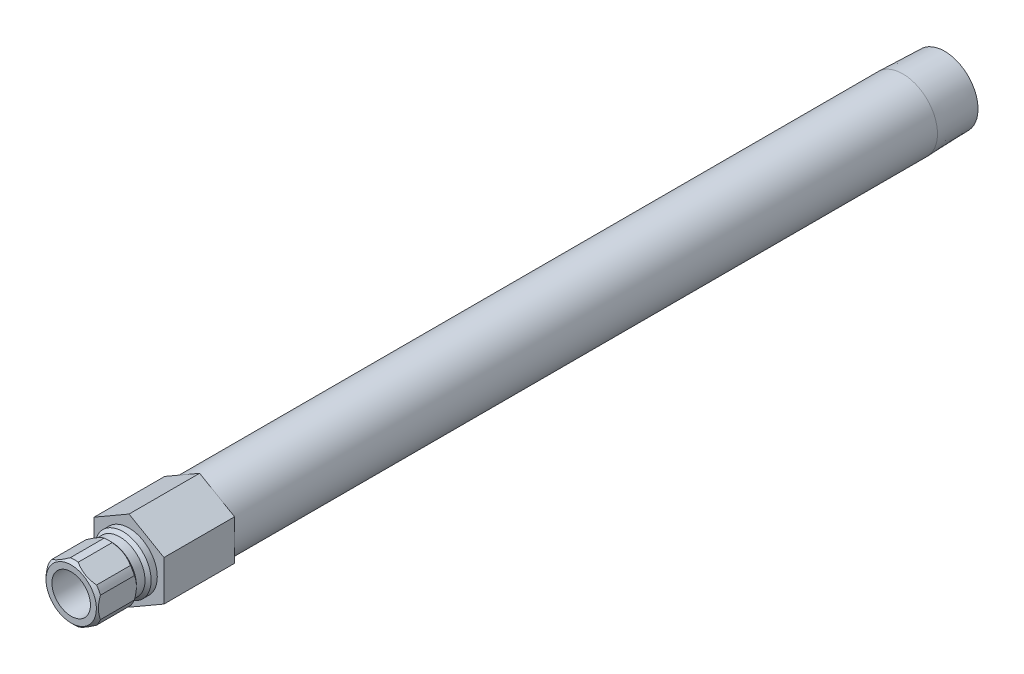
ISO-10303-21;
HEADER;
FILE_DESCRIPTION(('STEP AP214'),'2;1');
FILE_NAME('part.step','',(''),(''),'','','');
FILE_SCHEMA(('AUTOMOTIVE_DESIGN { 1 0 10303 214 1 1 1 1 }'));
ENDSEC;
DATA;
#1=APPLICATION_CONTEXT('core data for automotive mechanical design processes');
#2=APPLICATION_PROTOCOL_DEFINITION('international standard','automotive_design',2000,#1);
#3=PRODUCT_CONTEXT('',#1,'mechanical');
#4=PRODUCT('Part','Part','',(#3));
#5=PRODUCT_RELATED_PRODUCT_CATEGORY('part','',(#4));
#6=PRODUCT_DEFINITION_FORMATION('','',#4);
#7=PRODUCT_DEFINITION_CONTEXT('part definition',#1,'design');
#8=PRODUCT_DEFINITION('design','',#6,#7);
#9=PRODUCT_DEFINITION_SHAPE('','',#8);
#10=(LENGTH_UNIT() NAMED_UNIT(*) SI_UNIT(.MILLI.,.METRE.));
#11=(NAMED_UNIT(*) PLANE_ANGLE_UNIT() SI_UNIT($,.RADIAN.));
#12=(NAMED_UNIT(*) SI_UNIT($,.STERADIAN.) SOLID_ANGLE_UNIT());
#13=UNCERTAINTY_MEASURE_WITH_UNIT(LENGTH_MEASURE(1.E-05),#10,'distance_accuracy_value','');
#14=(GEOMETRIC_REPRESENTATION_CONTEXT(3) GLOBAL_UNCERTAINTY_ASSIGNED_CONTEXT((#13)) GLOBAL_UNIT_ASSIGNED_CONTEXT((#10,
#11,#12)) REPRESENTATION_CONTEXT('',''));
#15=CARTESIAN_POINT('',(0.,0.,0.));
#16=DIRECTION('',(0.,0.,1.));
#17=DIRECTION('',(1.,0.,0.));
#18=AXIS2_PLACEMENT_3D('',#15,#16,#17);
#19=CARTESIAN_POINT('',(0.,0.,0.));
#20=DIRECTION('',(0.,0.,-1.));
#21=DIRECTION('',(0.,1.,0.));
#22=AXIS2_PLACEMENT_3D('',#19,#20,#21);
#23=CYLINDRICAL_SURFACE('',#22,6.985);
#24=DIRECTION('',(0.,0.,-1.));
#25=VECTOR('',#24,1.);
#26=CARTESIAN_POINT('',(5.50323442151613,-4.30170151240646,0.));
#27=LINE('',#26,#25);
#28=CARTESIAN_POINT('',(5.50323442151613,-4.30170151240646,5.1562));
#29=VERTEX_POINT('',#28);
#30=CARTESIAN_POINT('',(5.50323442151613,-4.30170151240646,13.5382));
#31=VERTEX_POINT('',#30);
#32=EDGE_CURVE('E406',#29,#31,#27,.F.);
#33=ORIENTED_EDGE('',*,*,#32,.F.);
#34=CARTESIAN_POINT('',(0.,0.,5.1562));
#35=DIRECTION('',(0.,0.,-1.));
#36=DIRECTION('',(0.,1.,0.));
#37=AXIS2_PLACEMENT_3D('',#34,#35,#36);
#38=CIRCLE('',#37,6.985);
#39=CARTESIAN_POINT('',(6.477,-2.6150900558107,5.1562));
#40=VERTEX_POINT('',#39);
#41=EDGE_CURVE('E383',#40,#29,#38,.T.);
#42=ORIENTED_EDGE('',*,*,#41,.F.);
#43=DIRECTION('',(0.,0.,-1.));
#44=VECTOR('',#43,1.);
#45=CARTESIAN_POINT('',(6.477,-2.6150900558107,0.));
#46=LINE('',#45,#44);
#47=CARTESIAN_POINT('',(6.477,-2.6150900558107,13.5382));
#48=VERTEX_POINT('',#47);
#49=EDGE_CURVE('E397',#48,#40,#46,.T.);
#50=ORIENTED_EDGE('',*,*,#49,.F.);
#51=CARTESIAN_POINT('',(0.,0.,13.5382));
#52=DIRECTION('',(0.,0.,-1.));
#53=DIRECTION('',(0.,1.,0.));
#54=AXIS2_PLACEMENT_3D('',#51,#52,#53);
#55=CIRCLE('',#54,6.985);
#56=EDGE_CURVE('E191',#48,#31,#55,.T.);
#57=ORIENTED_EDGE('',*,*,#56,.T.);
#58=EDGE_LOOP('',(#33,#42,#50,#57));
#59=FACE_BOUND('',#58,.T.);
#60=ADVANCED_FACE('F34',(#59),#23,.T.);
#61=DIRECTION('',(0.,0.,-1.));
#62=VECTOR('',#61,1.);
#63=CARTESIAN_POINT('',(6.477,2.61509005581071,0.));
#64=LINE('',#63,#62);
#65=CARTESIAN_POINT('',(6.477,2.6150900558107,5.1562));
#66=VERTEX_POINT('',#65);
#67=CARTESIAN_POINT('',(6.477,2.61509005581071,13.5382));
#68=VERTEX_POINT('',#67);
#69=EDGE_CURVE('E309',#66,#68,#64,.F.);
#70=ORIENTED_EDGE('',*,*,#69,.F.);
#71=CARTESIAN_POINT('',(5.50323442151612,4.30170151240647,5.1562));
#72=VERTEX_POINT('',#71);
#73=EDGE_CURVE('E204',#72,#66,#38,.T.);
#74=ORIENTED_EDGE('',*,*,#73,.F.);
#75=DIRECTION('',(0.,0.,-1.));
#76=VECTOR('',#75,1.);
#77=CARTESIAN_POINT('',(5.50323442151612,4.30170151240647,0.));
#78=LINE('',#77,#76);
#79=CARTESIAN_POINT('',(5.50323442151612,4.30170151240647,13.5382));
#80=VERTEX_POINT('',#79);
#81=EDGE_CURVE('E394',#80,#72,#78,.T.);
#82=ORIENTED_EDGE('',*,*,#81,.F.);
#83=EDGE_CURVE('E198',#80,#68,#55,.T.);
#84=ORIENTED_EDGE('',*,*,#83,.T.);
#85=EDGE_LOOP('',(#70,#74,#82,#84));
#86=FACE_BOUND('',#85,.T.);
#87=ADVANCED_FACE('F343',(#86),#23,.T.);
#88=DIRECTION('',(0.,0.,-1.));
#89=VECTOR('',#88,1.);
#90=CARTESIAN_POINT('',(0.973765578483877,6.91679156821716,0.));
#91=LINE('',#90,#89);
#92=CARTESIAN_POINT('',(0.973765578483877,6.91679156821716,5.1562));
#93=VERTEX_POINT('',#92);
#94=CARTESIAN_POINT('',(0.973765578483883,6.91679156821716,13.5382));
#95=VERTEX_POINT('',#94);
#96=EDGE_CURVE('E399',#93,#95,#91,.F.);
#97=ORIENTED_EDGE('',*,*,#96,.F.);
#98=CARTESIAN_POINT('',(-0.973765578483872,6.91679156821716,5.1562));
#99=VERTEX_POINT('',#98);
#100=EDGE_CURVE('E200',#99,#93,#38,.T.);
#101=ORIENTED_EDGE('',*,*,#100,.F.);
#102=DIRECTION('',(0.,0.,-1.));
#103=VECTOR('',#102,1.);
#104=CARTESIAN_POINT('',(-0.973765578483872,6.91679156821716,0.));
#105=LINE('',#104,#103);
#106=CARTESIAN_POINT('',(-0.973765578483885,6.91679156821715,13.5382));
#107=VERTEX_POINT('',#106);
#108=EDGE_CURVE('E375',#107,#99,#105,.T.);
#109=ORIENTED_EDGE('',*,*,#108,.F.);
#110=EDGE_CURVE('E193',#107,#95,#55,.T.);
#111=ORIENTED_EDGE('',*,*,#110,.T.);
#112=EDGE_LOOP('',(#97,#101,#109,#111));
#113=FACE_BOUND('',#112,.T.);
#114=ADVANCED_FACE('F348',(#113),#23,.T.);
#115=DIRECTION('',(0.,0.,-1.));
#116=VECTOR('',#115,1.);
#117=CARTESIAN_POINT('',(-5.50323442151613,4.30170151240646,0.));
#118=LINE('',#117,#116);
#119=CARTESIAN_POINT('',(-5.50323442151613,4.30170151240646,5.1562));
#120=VERTEX_POINT('',#119);
#121=CARTESIAN_POINT('',(-5.50323442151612,4.30170151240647,13.5382));
#122=VERTEX_POINT('',#121);
#123=EDGE_CURVE('E54',#120,#122,#118,.F.);
#124=ORIENTED_EDGE('',*,*,#123,.F.);
#125=CARTESIAN_POINT('',(-6.477,2.61509005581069,5.1562));
#126=VERTEX_POINT('',#125);
#127=EDGE_CURVE('E203',#126,#120,#38,.T.);
#128=ORIENTED_EDGE('',*,*,#127,.F.);
#129=DIRECTION('',(0.,0.,-1.));
#130=VECTOR('',#129,1.);
#131=CARTESIAN_POINT('',(-6.477,2.61509005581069,0.));
#132=LINE('',#131,#130);
#133=CARTESIAN_POINT('',(-6.477,2.61509005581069,13.5382));
#134=VERTEX_POINT('',#133);
#135=EDGE_CURVE('E263',#134,#126,#132,.T.);
#136=ORIENTED_EDGE('',*,*,#135,.F.);
#137=EDGE_CURVE('E189',#134,#122,#55,.T.);
#138=ORIENTED_EDGE('',*,*,#137,.T.);
#139=EDGE_LOOP('',(#124,#128,#136,#138));
#140=FACE_BOUND('',#139,.T.);
#141=ADVANCED_FACE('F360',(#140),#23,.T.);
#142=DIRECTION('',(0.,0.,-1.));
#143=VECTOR('',#142,1.);
#144=CARTESIAN_POINT('',(-6.477,-2.61509005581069,0.));
#145=LINE('',#144,#143);
#146=CARTESIAN_POINT('',(-6.477,-2.61509005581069,5.1562));
#147=VERTEX_POINT('',#146);
#148=CARTESIAN_POINT('',(-6.477,-2.6150900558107,13.5382));
#149=VERTEX_POINT('',#148);
#150=EDGE_CURVE('E62',#147,#149,#145,.F.);
#151=ORIENTED_EDGE('',*,*,#150,.F.);
#152=CARTESIAN_POINT('',(-5.50323442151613,-4.30170151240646,5.1562));
#153=VERTEX_POINT('',#152);
#154=EDGE_CURVE('E182',#153,#147,#38,.T.);
#155=ORIENTED_EDGE('',*,*,#154,.F.);
#156=DIRECTION('',(0.,0.,-1.));
#157=VECTOR('',#156,1.);
#158=CARTESIAN_POINT('',(-5.50323442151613,-4.30170151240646,0.));
#159=LINE('',#158,#157);
#160=CARTESIAN_POINT('',(-5.50323442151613,-4.30170151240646,13.5382));
#161=VERTEX_POINT('',#160);
#162=EDGE_CURVE('E165',#161,#153,#159,.T.);
#163=ORIENTED_EDGE('',*,*,#162,.F.);
#164=EDGE_CURVE('E180',#161,#149,#55,.T.);
#165=ORIENTED_EDGE('',*,*,#164,.T.);
#166=EDGE_LOOP('',(#151,#155,#163,#165));
#167=FACE_BOUND('',#166,.T.);
#168=ADVANCED_FACE('F179',(#167),#23,.T.);
#169=CARTESIAN_POINT('',(0.,0.,0.));
#170=DIRECTION('',(0.,0.,-1.));
#171=DIRECTION('',(0.,1.,0.));
#172=AXIS2_PLACEMENT_3D('',#169,#170,#171);
#173=CYLINDRICAL_SURFACE('',#172,8.57249999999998);
#174=CARTESIAN_POINT('',(0.,0.,-191.262));
#175=DIRECTION('',(0.,0.,-1.));
#176=DIRECTION('',(0.,1.,0.));
#177=AXIS2_PLACEMENT_3D('',#174,#175,#176);
#178=CIRCLE('',#177,8.57249999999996);
#179=CARTESIAN_POINT('',(0.,8.5725,-191.262));
#180=VERTEX_POINT('',#179);
#181=EDGE_CURVE('E214',#180,#180,#178,.T.);
#182=ORIENTED_EDGE('',*,*,#181,.F.);
#183=EDGE_LOOP('',(#182));
#184=FACE_BOUND('',#183,.T.);
#185=CARTESIAN_POINT('',(0.,0.,-17.4498));
#186=DIRECTION('',(0.,0.,1.));
#187=DIRECTION('',(1.,0.,0.));
#188=AXIS2_PLACEMENT_3D('',#185,#186,#187);
#189=CIRCLE('',#188,8.57249999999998);
#190=CARTESIAN_POINT('',(8.57249999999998,0.,-17.4498));
#191=VERTEX_POINT('',#190);
#192=EDGE_CURVE('E231',#191,#191,#189,.F.);
#193=ORIENTED_EDGE('',*,*,#192,.T.);
#194=EDGE_LOOP('',(#193));
#195=FACE_BOUND('',#194,.T.);
#196=ADVANCED_FACE('F359',(#184,#195),#173,.T.);
#197=CARTESIAN_POINT('',(0.,0.,0.));
#198=DIRECTION('',(0.,0.,-1.));
#199=DIRECTION('',(0.,1.,0.));
#200=AXIS2_PLACEMENT_3D('',#197,#198,#199);
#201=CYLINDRICAL_SURFACE('',#200,4.76249999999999);
#202=CARTESIAN_POINT('',(0.,0.,14.3002));
#203=DIRECTION('',(0.,0.,-1.));
#204=DIRECTION('',(0.,1.,0.));
#205=AXIS2_PLACEMENT_3D('',#202,#203,#204);
#206=CIRCLE('',#205,4.7625);
#207=CARTESIAN_POINT('',(0.,4.7625,14.3002));
#208=VERTEX_POINT('',#207);
#209=EDGE_CURVE('E233',#208,#208,#206,.T.);
#210=ORIENTED_EDGE('',*,*,#209,.F.);
#211=EDGE_LOOP('',(#210));
#212=FACE_BOUND('',#211,.T.);
#213=CARTESIAN_POINT('',(0.,0.,-17.4498));
#214=DIRECTION('',(0.,0.,-1.));
#215=DIRECTION('',(0.,1.,0.));
#216=AXIS2_PLACEMENT_3D('',#213,#214,#215);
#217=CIRCLE('',#216,4.76249999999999);
#218=CARTESIAN_POINT('',(0.,4.7625,-17.4498));
#219=VERTEX_POINT('',#218);
#220=EDGE_CURVE('E226',#219,#219,#217,.T.);
#221=ORIENTED_EDGE('',*,*,#220,.T.);
#222=EDGE_LOOP('',(#221));
#223=FACE_BOUND('',#222,.T.);
#224=ADVANCED_FACE('F36',(#212,#223),#201,.F.);
#225=CARTESIAN_POINT('',(0.,4.7625,-17.4498));
#226=DIRECTION('',(0.,0.,-1.));
#227=DIRECTION('',(0.,1.,0.));
#228=AXIS2_PLACEMENT_3D('',#225,#226,#227);
#229=PLANE('',#228);
#230=CARTESIAN_POINT('',(0.,0.,-17.4498));
#231=DIRECTION('',(0.,0.,-1.));
#232=DIRECTION('',(0.,1.,0.));
#233=AXIS2_PLACEMENT_3D('',#230,#231,#232);
#234=CIRCLE('',#233,6.26109999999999);
#235=CARTESIAN_POINT('',(0.,6.2611,-17.4498));
#236=VERTEX_POINT('',#235);
#237=EDGE_CURVE('E223',#236,#236,#234,.T.);
#238=ORIENTED_EDGE('',*,*,#237,.T.);
#239=EDGE_LOOP('',(#238));
#240=FACE_BOUND('',#239,.T.);
#241=ORIENTED_EDGE('',*,*,#220,.F.);
#242=EDGE_LOOP('',(#241));
#243=FACE_BOUND('',#242,.T.);
#244=ADVANCED_FACE('F687',(#240,#243),#229,.T.);
#245=CARTESIAN_POINT('',(0.,0.,0.));
#246=DIRECTION('',(0.,0.,-1.));
#247=DIRECTION('',(0.,1.,0.));
#248=AXIS2_PLACEMENT_3D('',#245,#246,#247);
#249=CYLINDRICAL_SURFACE('',#248,6.26109999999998);
#250=CARTESIAN_POINT('',(0.,0.,-201.5998));
#251=DIRECTION('',(0.,0.,-1.));
#252=DIRECTION('',(0.,1.,0.));
#253=AXIS2_PLACEMENT_3D('',#250,#251,#252);
#254=CIRCLE('',#253,6.26109999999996);
#255=CARTESIAN_POINT('',(0.,6.2611,-201.5998));
#256=VERTEX_POINT('',#255);
#257=EDGE_CURVE('E220',#256,#256,#254,.T.);
#258=ORIENTED_EDGE('',*,*,#257,.T.);
#259=EDGE_LOOP('',(#258));
#260=FACE_BOUND('',#259,.T.);
#261=ORIENTED_EDGE('',*,*,#237,.F.);
#262=EDGE_LOOP('',(#261));
#263=FACE_BOUND('',#262,.T.);
#264=ADVANCED_FACE('F678',(#260,#263),#249,.F.);
#265=CARTESIAN_POINT('',(0.,8.24944566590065,-201.5998));
#266=DIRECTION('',(0.,0.,-1.));
#267=DIRECTION('',(0.,1.,0.));
#268=AXIS2_PLACEMENT_3D('',#265,#266,#267);
#269=PLANE('',#268);
#270=CARTESIAN_POINT('',(0.,0.,-201.5998));
#271=DIRECTION('',(0.,0.,-1.));
#272=DIRECTION('',(0.,1.,0.));
#273=AXIS2_PLACEMENT_3D('',#270,#271,#272);
#274=CIRCLE('',#273,8.24944566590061);
#275=CARTESIAN_POINT('',(0.,8.24944566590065,-201.5998));
#276=VERTEX_POINT('',#275);
#277=EDGE_CURVE('E217',#276,#276,#274,.T.);
#278=ORIENTED_EDGE('',*,*,#277,.T.);
#279=EDGE_LOOP('',(#278));
#280=FACE_BOUND('',#279,.T.);
#281=ORIENTED_EDGE('',*,*,#257,.F.);
#282=EDGE_LOOP('',(#281));
#283=FACE_BOUND('',#282,.T.);
#284=ADVANCED_FACE('F669',(#280,#283),#269,.T.);
#285=CARTESIAN_POINT('',(0.,0.,-201.5998));
#286=DIRECTION('',(0.,0.,1.));
#287=DIRECTION('',(0.,-1.,0.));
#288=AXIS2_PLACEMENT_3D('',#285,#286,#287);
#289=CONICAL_SURFACE('',#288,8.24944566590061,0.0312396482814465);
#290=ORIENTED_EDGE('',*,*,#181,.T.);
#291=EDGE_LOOP('',(#290));
#292=FACE_BOUND('',#291,.T.);
#293=ORIENTED_EDGE('',*,*,#277,.F.);
#294=EDGE_LOOP('',(#293));
#295=FACE_BOUND('',#294,.T.);
#296=ADVANCED_FACE('F661',(#292,#295),#289,.T.);
#297=CARTESIAN_POINT('',(0.,0.,0.));
#298=DIRECTION('',(0.,0.,-1.));
#299=DIRECTION('',(0.,1.,0.));
#300=AXIS2_PLACEMENT_3D('',#297,#298,#299);
#301=CYLINDRICAL_SURFACE('',#300,6.985);
#302=CARTESIAN_POINT('',(0.,0.,0.));
#303=DIRECTION('',(0.,0.,1.));
#304=DIRECTION('',(1.,0.,0.));
#305=AXIS2_PLACEMENT_3D('',#302,#303,#304);
#306=CIRCLE('',#305,6.985);
#307=CARTESIAN_POINT('',(6.985,0.,0.));
#308=VERTEX_POINT('',#307);
#309=EDGE_CURVE('E174',#308,#308,#306,.F.);
#310=ORIENTED_EDGE('',*,*,#309,.F.);
#311=EDGE_LOOP('',(#310));
#312=FACE_BOUND('',#311,.T.);
#313=CARTESIAN_POINT('',(0.,0.,1.50875999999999));
#314=DIRECTION('',(0.,0.,-1.));
#315=DIRECTION('',(0.,1.,0.));
#316=AXIS2_PLACEMENT_3D('',#313,#314,#315);
#317=CIRCLE('',#316,6.985);
#318=CARTESIAN_POINT('',(0.,6.985,1.50876));
#319=VERTEX_POINT('',#318);
#320=EDGE_CURVE('E211',#319,#319,#317,.T.);
#321=ORIENTED_EDGE('',*,*,#320,.T.);
#322=EDGE_LOOP('',(#321));
#323=FACE_BOUND('',#322,.T.);
#324=ADVANCED_FACE('F653',(#312,#323),#301,.T.);
#325=CARTESIAN_POINT('',(0.,0.,1.50875999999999));
#326=DIRECTION('',(0.,0.,-1.));
#327=DIRECTION('',(0.,1.,0.));
#328=AXIS2_PLACEMENT_3D('',#325,#326,#327);
#329=CONICAL_SURFACE('',#328,6.985,0.785398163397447);
#330=CARTESIAN_POINT('',(0.,0.,2.27076));
#331=DIRECTION('',(0.,0.,-1.));
#332=DIRECTION('',(0.,1.,0.));
#333=AXIS2_PLACEMENT_3D('',#330,#331,#332);
#334=CIRCLE('',#333,6.223);
#335=CARTESIAN_POINT('',(0.,6.223,2.27076));
#336=VERTEX_POINT('',#335);
#337=EDGE_CURVE('E208',#336,#336,#334,.T.);
#338=ORIENTED_EDGE('',*,*,#337,.T.);
#339=EDGE_LOOP('',(#338));
#340=FACE_BOUND('',#339,.T.);
#341=ORIENTED_EDGE('',*,*,#320,.F.);
#342=EDGE_LOOP('',(#341));
#343=FACE_BOUND('',#342,.T.);
#344=ADVANCED_FACE('F645',(#340,#343),#329,.T.);
#345=CARTESIAN_POINT('',(0.,0.,0.));
#346=DIRECTION('',(0.,0.,-1.));
#347=DIRECTION('',(0.,1.,0.));
#348=AXIS2_PLACEMENT_3D('',#345,#346,#347);
#349=CYLINDRICAL_SURFACE('',#348,6.223);
#350=CARTESIAN_POINT('',(0.,0.,4.3942));
#351=DIRECTION('',(0.,0.,-1.));
#352=DIRECTION('',(0.,1.,0.));
#353=AXIS2_PLACEMENT_3D('',#350,#351,#352);
#354=CIRCLE('',#353,6.223);
#355=CARTESIAN_POINT('',(0.,6.223,4.3942));
#356=VERTEX_POINT('',#355);
#357=EDGE_CURVE('E205',#356,#356,#354,.T.);
#358=ORIENTED_EDGE('',*,*,#357,.T.);
#359=EDGE_LOOP('',(#358));
#360=FACE_BOUND('',#359,.T.);
#361=ORIENTED_EDGE('',*,*,#337,.F.);
#362=EDGE_LOOP('',(#361));
#363=FACE_BOUND('',#362,.T.);
#364=ADVANCED_FACE('F270',(#360,#363),#349,.T.);
#365=CARTESIAN_POINT('',(0.,0.,4.3942));
#366=DIRECTION('',(0.,0.,1.));
#367=DIRECTION('',(0.,-1.,0.));
#368=AXIS2_PLACEMENT_3D('',#365,#366,#367);
#369=CONICAL_SURFACE('',#368,6.223,0.785398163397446);
#370=CARTESIAN_POINT('',(0.973302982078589,-6.91705864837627,5.1564));
#371=CARTESIAN_POINT('',(1.1543052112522,-6.81255696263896,5.07808330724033));
#372=CARTESIAN_POINT('',(1.3378209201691,-6.70660411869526,5.00684558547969));
#373=CARTESIAN_POINT('',(1.70963160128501,-6.49193912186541,4.88134753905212));
#374=CARTESIAN_POINT('',(1.89793754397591,-6.38322063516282,4.82713086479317));
#375=CARTESIAN_POINT('',(2.27146153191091,-6.16756646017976,4.74047563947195));
#376=CARTESIAN_POINT('',(2.45655498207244,-6.06070270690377,4.70733772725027));
#377=CARTESIAN_POINT('',(2.82844640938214,-5.8459910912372,4.66198043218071));
#378=CARTESIAN_POINT('',(3.0152419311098,-5.73814464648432,4.64973461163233));
#379=CARTESIAN_POINT('',(3.3948057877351,-5.51900335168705,4.64689437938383));
#380=CARTESIAN_POINT('',(3.58757842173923,-5.40770601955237,4.65698827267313));
#381=CARTESIAN_POINT('',(3.97148128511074,-5.18605959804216,4.69952919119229));
#382=CARTESIAN_POINT('',(4.1626089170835,-5.07571200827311,4.73200667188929));
#383=CARTESIAN_POINT('',(4.54854122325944,-4.85289388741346,4.81877263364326));
#384=CARTESIAN_POINT('',(4.74321398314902,-4.74049951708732,4.87383522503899));
#385=CARTESIAN_POINT('',(5.03141021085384,-4.57410934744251,4.97019209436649));
#386=CARTESIAN_POINT('',(5.12673323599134,-4.51907457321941,5.00455772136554));
#387=CARTESIAN_POINT('',(5.31613879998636,-4.40972121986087,5.07745547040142));
#388=CARTESIAN_POINT('',(5.41022179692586,-4.35540237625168,5.11598600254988));
#389=CARTESIAN_POINT('',(5.5036970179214,-4.30143443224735,5.1564));
#390=B_SPLINE_CURVE_WITH_KNOTS('',3,(#370,#371,#372,#373,#374,#375,#376,#377,#378,#379,#380,
#381,#382,#383,#384,#385,#386,#387,#388,#389),.UNSPECIFIED.,.F.,.F.,(4,2,2,2,2,2,2,2,2,4),(0.,
0.669810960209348,1.34132587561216,1.9892054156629,2.63626449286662,3.3035366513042,
3.9717185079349,4.66502165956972,5.01088265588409,5.35661208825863),.UNSPECIFIED.);
#391=CARTESIAN_POINT('',(0.973765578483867,-6.91679156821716,5.1562));
#392=VERTEX_POINT('',#391);
#393=EDGE_CURVE('E408',#392,#29,#390,.T.);
#394=ORIENTED_EDGE('',*,*,#393,.F.);
#395=CARTESIAN_POINT('',(-0.973765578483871,-6.91679156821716,5.1562));
#396=VERTEX_POINT('',#395);
#397=EDGE_CURVE('E381',#392,#396,#38,.T.);
#398=ORIENTED_EDGE('',*,*,#397,.T.);
#399=CARTESIAN_POINT('',(-5.50369701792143,-4.30143443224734,5.15640000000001));
#400=CARTESIAN_POINT('',(-5.32269478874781,-4.40593611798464,5.07808330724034));
#401=CARTESIAN_POINT('',(-5.13917907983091,-4.51188896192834,5.0068455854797));
#402=CARTESIAN_POINT('',(-4.767368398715,-4.72655395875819,4.88134753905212));
#403=CARTESIAN_POINT('',(-4.5790624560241,-4.83527244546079,4.82713086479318));
#404=CARTESIAN_POINT('',(-4.2055384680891,-5.05092662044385,4.74047563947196));
#405=CARTESIAN_POINT('',(-4.02044501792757,-5.15779037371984,4.70733772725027));
#406=CARTESIAN_POINT('',(-3.64855359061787,-5.37250198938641,4.66198043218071));
#407=CARTESIAN_POINT('',(-3.46175806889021,-5.48034843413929,4.64973461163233));
#408=CARTESIAN_POINT('',(-3.08219421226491,-5.69948972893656,4.64689437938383));
#409=CARTESIAN_POINT('',(-2.88942157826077,-5.81078706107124,4.65698827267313));
#410=CARTESIAN_POINT('',(-2.50551871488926,-6.03243348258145,4.69952919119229));
#411=CARTESIAN_POINT('',(-2.3143910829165,-6.1427810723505,4.73200667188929));
#412=CARTESIAN_POINT('',(-1.92845877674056,-6.36559919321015,4.81877263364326));
#413=CARTESIAN_POINT('',(-1.73378601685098,-6.47799356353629,4.87383522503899));
#414=CARTESIAN_POINT('',(-1.44558978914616,-6.6443837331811,4.97019209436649));
#415=CARTESIAN_POINT('',(-1.35026676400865,-6.69941850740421,5.00455772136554));
#416=CARTESIAN_POINT('',(-1.16086120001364,-6.80877186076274,5.07745547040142));
#417=CARTESIAN_POINT('',(-1.06677820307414,-6.86309070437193,5.11598600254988));
#418=CARTESIAN_POINT('',(-0.973302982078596,-6.91705864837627,5.1564));
#419=B_SPLINE_CURVE_WITH_KNOTS('',3,(#399,#400,#401,#402,#403,#404,#405,#406,#407,#408,#409,
#410,#411,#412,#413,#414,#415,#416,#417,#418),.UNSPECIFIED.,.F.,.F.,(4,2,2,2,2,2,2,2,2,4),(0.,
0.669810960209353,1.34132587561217,1.98920541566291,2.63626449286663,3.30353665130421,
3.97171850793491,4.66502165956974,5.01088265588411,5.35661208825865),.UNSPECIFIED.);
#420=EDGE_CURVE('E256',#153,#396,#419,.T.);
#421=ORIENTED_EDGE('',*,*,#420,.F.);
#422=ORIENTED_EDGE('',*,*,#154,.T.);
#423=CARTESIAN_POINT('',(-6.477,-7.50531717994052,8.08489330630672));
#424=CARTESIAN_POINT('',(-6.477,-7.32278230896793,7.94673378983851));
#425=CARTESIAN_POINT('',(-6.477,-7.13923073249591,7.80989578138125));
#426=CARTESIAN_POINT('',(-6.477,-6.76969107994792,7.53945615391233));
#427=CARTESIAN_POINT('',(-6.477,-6.58370240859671,7.40585534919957));
#428=CARTESIAN_POINT('',(-6.477,-6.20752484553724,7.14153325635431));
#429=CARTESIAN_POINT('',(-6.477,-6.01731457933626,7.01084228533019));
#430=CARTESIAN_POINT('',(-6.477,-5.63367369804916,6.75429124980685));
#431=CARTESIAN_POINT('',(-6.477,-5.44024331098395,6.62843084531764));
#432=CARTESIAN_POINT('',(-6.477,-5.03831720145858,6.37548971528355));
#433=CARTESIAN_POINT('',(-6.477,-4.82959841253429,6.24876164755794));
#434=CARTESIAN_POINT('',(-6.477,-4.40728395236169,6.00357587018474));
#435=CARTESIAN_POINT('',(-6.477,-4.19368750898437,5.88511948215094));
#436=CARTESIAN_POINT('',(-6.477,-3.7616267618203,5.6590284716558));
#437=CARTESIAN_POINT('',(-6.477,-3.54317924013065,5.55136202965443));
#438=CARTESIAN_POINT('',(-6.477,-3.100295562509,5.34926153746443));
#439=CARTESIAN_POINT('',(-6.477,-2.87586219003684,5.25482146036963));
#440=CARTESIAN_POINT('',(-6.477,-2.43955826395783,5.0897033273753));
#441=CARTESIAN_POINT('',(-6.477,-2.22819339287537,5.0177028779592));
#442=CARTESIAN_POINT('',(-6.477,-1.80033354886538,4.8906524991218));
#443=CARTESIAN_POINT('',(-6.477,-1.58383822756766,4.8356037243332));
#444=CARTESIAN_POINT('',(-6.477,-1.15063390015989,4.74626140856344));
#445=CARTESIAN_POINT('',(-6.477,-0.934000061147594,4.7116093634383));
#446=CARTESIAN_POINT('',(-6.477,-0.498364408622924,4.66374056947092));
#447=CARTESIAN_POINT('',(-6.477,-0.279363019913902,4.65052003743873));
#448=CARTESIAN_POINT('',(-6.477,0.15069719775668,4.64651642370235));
#449=CARTESIAN_POINT('',(-6.477,0.361748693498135,4.65491764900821));
#450=CARTESIAN_POINT('',(-6.477,0.782066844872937,4.69188275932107));
#451=CARTESIAN_POINT('',(-6.477,0.991333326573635,4.72044858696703));
#452=CARTESIAN_POINT('',(-6.477,1.41010575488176,4.79666246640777));
#453=CARTESIAN_POINT('',(-6.477,1.61955133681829,4.84463689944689));
#454=CARTESIAN_POINT('',(-6.477,2.03387291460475,4.95709535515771));
#455=CARTESIAN_POINT('',(-6.477,2.2387492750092,5.0215780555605));
#456=CARTESIAN_POINT('',(-6.477,2.66141718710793,5.17064013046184));
#457=CARTESIAN_POINT('',(-6.477,2.87875617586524,5.25648961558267));
#458=CARTESIAN_POINT('',(-6.477,3.30779766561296,5.44138196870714));
#459=CARTESIAN_POINT('',(-6.477,3.51949749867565,5.54043095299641));
#460=CARTESIAN_POINT('',(-6.477,3.93828980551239,5.74936705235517));
#461=CARTESIAN_POINT('',(-6.477,4.14536521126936,5.85928810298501));
#462=CARTESIAN_POINT('',(-6.477,4.55475391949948,6.08754039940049));
#463=CARTESIAN_POINT('',(-6.477,4.75706796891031,6.20587031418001));
#464=CARTESIAN_POINT('',(-6.477,5.14761370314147,6.44323908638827));
#465=CARTESIAN_POINT('',(-6.477,5.33604552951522,6.56195038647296));
#466=CARTESIAN_POINT('',(-6.477,5.7096738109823,6.80437488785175));
#467=CARTESIAN_POINT('',(-6.477,5.89487001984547,6.92808846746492));
#468=CARTESIAN_POINT('',(-6.477,6.26095063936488,7.17860412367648));
#469=CARTESIAN_POINT('',(-6.477,6.44185783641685,7.3053730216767));
#470=CARTESIAN_POINT('',(-6.477,6.8011983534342,7.56227065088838));
#471=CARTESIAN_POINT('',(-6.477,6.97963234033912,7.69239844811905));
#472=CARTESIAN_POINT('',(-6.477,7.15703038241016,7.82389977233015));
#473=B_SPLINE_CURVE_WITH_KNOTS('',3,(#423,#424,#425,#426,#427,#428,#429,#430,#431,#432,#433,
#434,#435,#436,#437,#438,#439,#440,#441,#442,#443,#444,#445,#446,#447,#448,#449,#450,#451,#452,
#453,#454,#455,#456,#457,#458,#459,#460,#461,#462,#463,#464,#465,#466,#467,#468,#469,#470,#471,
#472),.UNSPECIFIED.,.F.,.F.,(4,2,2,2,2,2,2,2,2,2,2,2,2,2,2,2,2,2,2,2,2,2,2,2,4),(0.,
0.686790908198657,1.37375281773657,2.06603541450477,2.75826919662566,3.49065471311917,
4.22315698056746,4.95343127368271,5.68337170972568,6.352659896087,7.02199365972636,
7.67918147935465,8.33625327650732,8.96890298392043,9.60161364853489,10.2454384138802,
10.8892116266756,11.5897073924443,12.2905288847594,12.9936114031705,13.6965828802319,
14.3646145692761,15.0326968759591,15.6953618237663,16.3578444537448),.UNSPECIFIED.);
#474=EDGE_CURVE('E279',#126,#147,#473,.F.);
#475=ORIENTED_EDGE('',*,*,#474,.F.);
#476=ORIENTED_EDGE('',*,*,#127,.T.);
#477=CARTESIAN_POINT('',(-0.973302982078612,6.91705864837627,5.1564));
#478=CARTESIAN_POINT('',(-1.15430521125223,6.81255696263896,5.07808330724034));
#479=CARTESIAN_POINT('',(-1.33782092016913,6.70660411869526,5.0068455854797));
#480=CARTESIAN_POINT('',(-1.70963160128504,6.49193912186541,4.88134753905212));
#481=CARTESIAN_POINT('',(-1.89793754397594,6.38322063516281,4.82713086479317));
#482=CARTESIAN_POINT('',(-2.27146153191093,6.16756646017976,4.74047563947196));
#483=CARTESIAN_POINT('',(-2.45655498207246,6.06070270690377,4.70733772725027));
#484=CARTESIAN_POINT('',(-2.82844640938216,5.8459910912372,4.66198043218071));
#485=CARTESIAN_POINT('',(-3.01524193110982,5.73814464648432,4.64973461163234));
#486=CARTESIAN_POINT('',(-3.39480578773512,5.51900335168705,4.64689437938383));
#487=CARTESIAN_POINT('',(-3.58757842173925,5.40770601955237,4.65698827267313));
#488=CARTESIAN_POINT('',(-3.97148128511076,5.18605959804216,4.6995291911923));
#489=CARTESIAN_POINT('',(-4.16260891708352,5.07571200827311,4.7320066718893));
#490=CARTESIAN_POINT('',(-4.54854122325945,4.85289388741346,4.81877263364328));
#491=CARTESIAN_POINT('',(-4.74321398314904,4.74049951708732,4.873835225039));
#492=CARTESIAN_POINT('',(-5.03141021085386,4.57410934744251,4.9701920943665));
#493=CARTESIAN_POINT('',(-5.12673323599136,4.51907457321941,5.00455772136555));
#494=CARTESIAN_POINT('',(-5.31613879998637,4.40972121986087,5.07745547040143));
#495=CARTESIAN_POINT('',(-5.41022179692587,4.35540237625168,5.11598600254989));
#496=CARTESIAN_POINT('',(-5.50369701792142,4.30143443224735,5.15640000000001));
#497=B_SPLINE_CURVE_WITH_KNOTS('',3,(#477,#478,#479,#480,#481,#482,#483,#484,#485,#486,#487,
#488,#489,#490,#491,#492,#493,#494,#495,#496),.UNSPECIFIED.,.F.,.F.,(4,2,2,2,2,2,2,2,2,4),(0.,
0.669810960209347,1.34132587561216,1.9892054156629,2.63626449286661,3.30353665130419,
3.97171850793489,4.66502165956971,5.01088265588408,5.35661208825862),.UNSPECIFIED.);
#498=EDGE_CURVE('E286',#99,#120,#497,.T.);
#499=ORIENTED_EDGE('',*,*,#498,.F.);
#500=ORIENTED_EDGE('',*,*,#100,.T.);
#501=CARTESIAN_POINT('',(5.50369701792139,4.30143443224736,5.1564));
#502=CARTESIAN_POINT('',(5.32269478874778,4.40593611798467,5.07808330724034));
#503=CARTESIAN_POINT('',(5.13917907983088,4.51188896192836,5.00684558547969));
#504=CARTESIAN_POINT('',(4.76736839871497,4.72655395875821,4.88134753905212));
#505=CARTESIAN_POINT('',(4.57906245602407,4.83527244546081,4.82713086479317));
#506=CARTESIAN_POINT('',(4.20553846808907,5.05092662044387,4.74047563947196));
#507=CARTESIAN_POINT('',(4.02044501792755,5.15779037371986,4.70733772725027));
#508=CARTESIAN_POINT('',(3.64855359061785,5.37250198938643,4.66198043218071));
#509=CARTESIAN_POINT('',(3.46175806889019,5.48034843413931,4.64973461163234));
#510=CARTESIAN_POINT('',(3.08219421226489,5.69948972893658,4.64689437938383));
#511=CARTESIAN_POINT('',(2.88942157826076,5.81078706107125,4.65698827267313));
#512=CARTESIAN_POINT('',(2.50551871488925,6.03243348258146,4.6995291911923));
#513=CARTESIAN_POINT('',(2.3143910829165,6.14278107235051,4.7320066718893));
#514=CARTESIAN_POINT('',(1.92845877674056,6.36559919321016,4.81877263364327));
#515=CARTESIAN_POINT('',(1.73378601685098,6.47799356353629,4.873835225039));
#516=CARTESIAN_POINT('',(1.44558978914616,6.6443837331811,4.97019209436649));
#517=CARTESIAN_POINT('',(1.35026676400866,6.69941850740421,5.00455772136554));
#518=CARTESIAN_POINT('',(1.16086120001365,6.80877186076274,5.07745547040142));
#519=CARTESIAN_POINT('',(1.06677820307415,6.86309070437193,5.11598600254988));
#520=CARTESIAN_POINT('',(0.973302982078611,6.91705864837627,5.1564));
#521=B_SPLINE_CURVE_WITH_KNOTS('',3,(#501,#502,#503,#504,#505,#506,#507,#508,#509,#510,#511,
#512,#513,#514,#515,#516,#517,#518,#519,#520),.UNSPECIFIED.,.F.,.F.,(4,2,2,2,2,2,2,2,2,4),(0.,
0.669810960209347,1.34132587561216,1.9892054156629,2.63626449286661,3.30353665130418,
3.97171850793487,4.66502165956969,5.01088265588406,5.35661208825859),.UNSPECIFIED.);
#522=EDGE_CURVE('E293',#72,#93,#521,.T.);
#523=ORIENTED_EDGE('',*,*,#522,.F.);
#524=ORIENTED_EDGE('',*,*,#73,.T.);
#525=CARTESIAN_POINT('',(6.477,-7.50531717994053,8.08489330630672));
#526=CARTESIAN_POINT('',(6.477,-7.32278230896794,7.94673378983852));
#527=CARTESIAN_POINT('',(6.477,-7.13923073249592,7.80989578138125));
#528=CARTESIAN_POINT('',(6.477,-6.76969107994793,7.53945615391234));
#529=CARTESIAN_POINT('',(6.477,-6.58370240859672,7.40585534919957));
#530=CARTESIAN_POINT('',(6.477,-6.20752484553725,7.14153325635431));
#531=CARTESIAN_POINT('',(6.477,-6.01731457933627,7.01084228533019));
#532=CARTESIAN_POINT('',(6.477,-5.63367369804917,6.75429124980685));
#533=CARTESIAN_POINT('',(6.477,-5.44024331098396,6.62843084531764));
#534=CARTESIAN_POINT('',(6.477,-5.03831720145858,6.37548971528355));
#535=CARTESIAN_POINT('',(6.477,-4.8295984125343,6.24876164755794));
#536=CARTESIAN_POINT('',(6.477,-4.4072839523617,6.00357587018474));
#537=CARTESIAN_POINT('',(6.477,-4.19368750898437,5.88511948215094));
#538=CARTESIAN_POINT('',(6.477,-3.7616267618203,5.6590284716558));
#539=CARTESIAN_POINT('',(6.477,-3.54317924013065,5.55136202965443));
#540=CARTESIAN_POINT('',(6.477,-3.100295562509,5.34926153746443));
#541=CARTESIAN_POINT('',(6.477,-2.87586219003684,5.25482146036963));
#542=CARTESIAN_POINT('',(6.477,-2.43955826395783,5.0897033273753));
#543=CARTESIAN_POINT('',(6.477,-2.22819339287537,5.0177028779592));
#544=CARTESIAN_POINT('',(6.477,-1.80033354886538,4.89065249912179));
#545=CARTESIAN_POINT('',(6.477,-1.58383822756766,4.8356037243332));
#546=CARTESIAN_POINT('',(6.477,-1.15063390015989,4.74626140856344));
#547=CARTESIAN_POINT('',(6.477,-0.934000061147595,4.71160936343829));
#548=CARTESIAN_POINT('',(6.477,-0.498364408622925,4.66374056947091));
#549=CARTESIAN_POINT('',(6.477,-0.279363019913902,4.65052003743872));
#550=CARTESIAN_POINT('',(6.477,0.150697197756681,4.64651642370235));
#551=CARTESIAN_POINT('',(6.477,0.361748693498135,4.6549176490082));
#552=CARTESIAN_POINT('',(6.477,0.782066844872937,4.69188275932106));
#553=CARTESIAN_POINT('',(6.477,0.991333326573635,4.72044858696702));
#554=CARTESIAN_POINT('',(6.477,1.41010575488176,4.79666246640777));
#555=CARTESIAN_POINT('',(6.477,1.6195513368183,4.84463689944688));
#556=CARTESIAN_POINT('',(6.477,2.03387291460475,4.95709535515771));
#557=CARTESIAN_POINT('',(6.477,2.2387492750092,5.02157805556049));
#558=CARTESIAN_POINT('',(6.477,2.66141718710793,5.17064013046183));
#559=CARTESIAN_POINT('',(6.477,2.87875617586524,5.25648961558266));
#560=CARTESIAN_POINT('',(6.477,3.30779766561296,5.44138196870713));
#561=CARTESIAN_POINT('',(6.477,3.51949749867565,5.54043095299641));
#562=CARTESIAN_POINT('',(6.477,3.93828980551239,5.74936705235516));
#563=CARTESIAN_POINT('',(6.477,4.14536521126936,5.859288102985));
#564=CARTESIAN_POINT('',(6.477,4.55475391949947,6.08754039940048));
#565=CARTESIAN_POINT('',(6.477,4.75706796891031,6.20587031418));
#566=CARTESIAN_POINT('',(6.477,5.14761370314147,6.44323908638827));
#567=CARTESIAN_POINT('',(6.477,5.33604552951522,6.56195038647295));
#568=CARTESIAN_POINT('',(6.477,5.7096738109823,6.80437488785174));
#569=CARTESIAN_POINT('',(6.477,5.89487001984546,6.92808846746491));
#570=CARTESIAN_POINT('',(6.477,6.26095063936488,7.17860412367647));
#571=CARTESIAN_POINT('',(6.477,6.44185783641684,7.3053730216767));
#572=CARTESIAN_POINT('',(6.477,6.80119835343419,7.56227065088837));
#573=CARTESIAN_POINT('',(6.477,6.97963234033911,7.69239844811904));
#574=CARTESIAN_POINT('',(6.477,7.15703038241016,7.82389977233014));
#575=B_SPLINE_CURVE_WITH_KNOTS('',3,(#525,#526,#527,#528,#529,#530,#531,#532,#533,#534,#535,
#536,#537,#538,#539,#540,#541,#542,#543,#544,#545,#546,#547,#548,#549,#550,#551,#552,#553,#554,
#555,#556,#557,#558,#559,#560,#561,#562,#563,#564,#565,#566,#567,#568,#569,#570,#571,#572,#573,
#574),.UNSPECIFIED.,.F.,.F.,(4,2,2,2,2,2,2,2,2,2,2,2,2,2,2,2,2,2,2,2,2,2,2,2,4),(0.,
0.686790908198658,1.37375281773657,2.06603541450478,2.75826919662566,3.49065471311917,
4.22315698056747,4.95343127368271,5.68337170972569,6.35265989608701,7.02199365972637,
7.67918147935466,8.33625327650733,8.96890298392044,9.6016136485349,10.2454384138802,
10.8892116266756,11.5897073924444,12.2905288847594,12.9936114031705,13.6965828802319,
14.3646145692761,15.0326968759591,15.6953618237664,16.3578444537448),.UNSPECIFIED.);
#576=EDGE_CURVE('E301',#40,#66,#575,.T.);
#577=ORIENTED_EDGE('',*,*,#576,.F.);
#578=ORIENTED_EDGE('',*,*,#41,.T.);
#579=EDGE_LOOP('',(#394,#398,#421,#422,#475,#476,#499,#500,#523,#524,#577,#578));
#580=FACE_BOUND('',#579,.T.);
#581=ORIENTED_EDGE('',*,*,#357,.F.);
#582=EDGE_LOOP('',(#581));
#583=FACE_BOUND('',#582,.T.);
#584=ADVANCED_FACE('F265',(#580,#583),#369,.T.);
#585=DIRECTION('',(0.,0.,-1.));
#586=VECTOR('',#585,1.);
#587=CARTESIAN_POINT('',(0.973765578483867,-6.91679156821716,0.));
#588=LINE('',#587,#586);
#589=CARTESIAN_POINT('',(0.973765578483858,-6.91679156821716,13.5382));
#590=VERTEX_POINT('',#589);
#591=EDGE_CURVE('E308',#590,#392,#588,.T.);
#592=ORIENTED_EDGE('',*,*,#591,.F.);
#593=CARTESIAN_POINT('',(-0.973765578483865,-6.91679156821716,13.5382));
#594=VERTEX_POINT('',#593);
#595=EDGE_CURVE('E188',#590,#594,#55,.T.);
#596=ORIENTED_EDGE('',*,*,#595,.T.);
#597=DIRECTION('',(0.,0.,-1.));
#598=VECTOR('',#597,1.);
#599=CARTESIAN_POINT('',(-0.973765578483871,-6.91679156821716,0.));
#600=LINE('',#599,#598);
#601=EDGE_CURVE('E168',#396,#594,#600,.F.);
#602=ORIENTED_EDGE('',*,*,#601,.F.);
#603=ORIENTED_EDGE('',*,*,#397,.F.);
#604=EDGE_LOOP('',(#592,#596,#602,#603));
#605=FACE_BOUND('',#604,.T.);
#606=ADVANCED_FACE('F269',(#605),#23,.T.);
#607=CARTESIAN_POINT('',(0.,0.,13.5382));
#608=DIRECTION('',(0.,0.,-1.));
#609=DIRECTION('',(0.,1.,0.));
#610=AXIS2_PLACEMENT_3D('',#607,#608,#609);
#611=CONICAL_SURFACE('',#610,6.985,0.78539816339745);
#612=CARTESIAN_POINT('',(5.5036970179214,-4.30143443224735,13.538));
#613=CARTESIAN_POINT('',(5.32269478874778,-4.40593611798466,13.6163166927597));
#614=CARTESIAN_POINT('',(5.13917907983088,-4.51188896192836,13.6875544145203));
#615=CARTESIAN_POINT('',(4.76736839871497,-4.72655395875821,13.8130524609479));
#616=CARTESIAN_POINT('',(4.57906245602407,-4.8352724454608,13.8672691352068));
#617=CARTESIAN_POINT('',(4.20553846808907,-5.05092662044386,13.953924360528));
#618=CARTESIAN_POINT('',(4.02044501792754,-5.15779037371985,13.9870622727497));
#619=CARTESIAN_POINT('',(3.64855359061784,-5.37250198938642,14.0324195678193));
#620=CARTESIAN_POINT('',(3.46175806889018,-5.4803484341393,14.0446653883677));
#621=CARTESIAN_POINT('',(3.08219421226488,-5.69948972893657,14.0475056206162));
#622=CARTESIAN_POINT('',(2.88942157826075,-5.81078706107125,14.0374117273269));
#623=CARTESIAN_POINT('',(2.50551871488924,-6.03243348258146,13.9948708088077));
#624=CARTESIAN_POINT('',(2.31439108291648,-6.14278107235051,13.9623933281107));
#625=CARTESIAN_POINT('',(1.92845877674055,-6.36559919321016,13.8756273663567));
#626=CARTESIAN_POINT('',(1.73378601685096,-6.4779935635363,13.820564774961));
#627=CARTESIAN_POINT('',(1.44558978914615,-6.64438373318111,13.7242079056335));
#628=CARTESIAN_POINT('',(1.35026676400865,-6.69941850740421,13.6898422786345));
#629=CARTESIAN_POINT('',(1.16086120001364,-6.80877186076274,13.6169445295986));
#630=CARTESIAN_POINT('',(1.06677820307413,-6.86309070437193,13.5784139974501));
#631=CARTESIAN_POINT('',(0.973302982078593,-6.91705864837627,13.538));
#632=B_SPLINE_CURVE_WITH_KNOTS('',3,(#612,#613,#614,#615,#616,#617,#618,#619,#620,#621,#622,
#623,#624,#625,#626,#627,#628,#629,#630,#631),.UNSPECIFIED.,.F.,.F.,(4,2,2,2,2,2,2,2,2,4),(0.,
0.66981096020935,1.34132587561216,1.98920541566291,2.63626449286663,3.3035366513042,
3.9717185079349,4.66502165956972,5.01088265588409,5.35661208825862),.UNSPECIFIED.);
#633=EDGE_CURVE('E12',#31,#590,#632,.T.);
#634=ORIENTED_EDGE('',*,*,#633,.F.);
#635=ORIENTED_EDGE('',*,*,#56,.F.);
#636=CARTESIAN_POINT('',(6.477,-7.50531717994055,10.6095066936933));
#637=CARTESIAN_POINT('',(6.477,-7.32278230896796,10.7476662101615));
#638=CARTESIAN_POINT('',(6.477,-7.13923073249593,10.8845042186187));
#639=CARTESIAN_POINT('',(6.477,-6.76969107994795,11.1549438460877));
#640=CARTESIAN_POINT('',(6.477,-6.58370240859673,11.2885446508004));
#641=CARTESIAN_POINT('',(6.477,-6.20752484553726,11.5528667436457));
#642=CARTESIAN_POINT('',(6.477,-6.01731457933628,11.6835577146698));
#643=CARTESIAN_POINT('',(6.477,-5.63367369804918,11.9401087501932));
#644=CARTESIAN_POINT('',(6.477,-5.44024331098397,12.0659691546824));
#645=CARTESIAN_POINT('',(6.477,-5.03831720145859,12.3189102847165));
#646=CARTESIAN_POINT('',(6.477,-4.82959841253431,12.4456383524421));
#647=CARTESIAN_POINT('',(6.477,-4.4072839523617,12.6908241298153));
#648=CARTESIAN_POINT('',(6.477,-4.19368750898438,12.8092805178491));
#649=CARTESIAN_POINT('',(6.477,-3.76162676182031,13.0353715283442));
#650=CARTESIAN_POINT('',(6.477,-3.54317924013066,13.1430379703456));
#651=CARTESIAN_POINT('',(6.477,-3.100295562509,13.3451384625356));
#652=CARTESIAN_POINT('',(6.477,-2.87586219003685,13.4395785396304));
#653=CARTESIAN_POINT('',(6.477,-2.43955826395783,13.6046966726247));
#654=CARTESIAN_POINT('',(6.477,-2.22819339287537,13.6766971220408));
#655=CARTESIAN_POINT('',(6.477,-1.80033354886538,13.8037475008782));
#656=CARTESIAN_POINT('',(6.477,-1.58383822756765,13.8587962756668));
#657=CARTESIAN_POINT('',(6.477,-1.15063390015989,13.9481385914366));
#658=CARTESIAN_POINT('',(6.477,-0.934000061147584,13.9827906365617));
#659=CARTESIAN_POINT('',(6.477,-0.498364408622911,14.0306594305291));
#660=CARTESIAN_POINT('',(6.477,-0.279363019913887,14.0438799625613));
#661=CARTESIAN_POINT('',(6.477,0.150697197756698,14.0478835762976));
#662=CARTESIAN_POINT('',(6.477,0.361748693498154,14.0394823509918));
#663=CARTESIAN_POINT('',(6.477,0.782066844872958,14.0025172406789));
#664=CARTESIAN_POINT('',(6.477,0.991333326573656,13.973951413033));
#665=CARTESIAN_POINT('',(6.477,1.41010575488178,13.8977375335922));
#666=CARTESIAN_POINT('',(6.477,1.61955133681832,13.8497631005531));
#667=CARTESIAN_POINT('',(6.477,2.03387291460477,13.7373046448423));
#668=CARTESIAN_POINT('',(6.477,2.23874927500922,13.6728219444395));
#669=CARTESIAN_POINT('',(6.477,2.66141718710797,13.5237598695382));
#670=CARTESIAN_POINT('',(6.477,2.87875617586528,13.4379103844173));
#671=CARTESIAN_POINT('',(6.477,3.307797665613,13.2530180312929));
#672=CARTESIAN_POINT('',(6.477,3.51949749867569,13.1539690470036));
#673=CARTESIAN_POINT('',(6.477,3.93828980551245,12.9450329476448));
#674=CARTESIAN_POINT('',(6.477,4.14536521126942,12.835111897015));
#675=CARTESIAN_POINT('',(6.477,4.55475391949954,12.6068596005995));
#676=CARTESIAN_POINT('',(6.477,4.75706796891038,12.48852968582));
#677=CARTESIAN_POINT('',(6.477,5.14761370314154,12.2511609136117));
#678=CARTESIAN_POINT('',(6.477,5.3360455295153,12.132449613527));
#679=CARTESIAN_POINT('',(6.477,5.70967381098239,11.8900251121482));
#680=CARTESIAN_POINT('',(6.477,5.89487001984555,11.766311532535));
#681=CARTESIAN_POINT('',(6.477,6.26095063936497,11.5157958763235));
#682=CARTESIAN_POINT('',(6.477,6.44185783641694,11.3890269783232));
#683=CARTESIAN_POINT('',(6.477,6.8011983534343,11.1321293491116));
#684=CARTESIAN_POINT('',(6.477,6.97963234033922,11.0020015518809));
#685=CARTESIAN_POINT('',(6.477,7.15703038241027,10.8705002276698));
#686=B_SPLINE_CURVE_WITH_KNOTS('',3,(#636,#637,#638,#639,#640,#641,#642,#643,#644,#645,#646,
#647,#648,#649,#650,#651,#652,#653,#654,#655,#656,#657,#658,#659,#660,#661,#662,#663,#664,#665,
#666,#667,#668,#669,#670,#671,#672,#673,#674,#675,#676,#677,#678,#679,#680,#681,#682,#683,#684,
#685),.UNSPECIFIED.,.F.,.F.,(4,2,2,2,2,2,2,2,2,2,2,2,2,2,2,2,2,2,2,2,2,2,2,2,4),(0.,
0.686790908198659,1.37375281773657,2.06603541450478,2.75826919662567,3.49065471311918,
4.22315698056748,4.95343127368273,5.6833717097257,6.35265989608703,7.0219936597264,
7.67918147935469,8.33625327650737,8.96890298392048,9.60161364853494,10.2454384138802,
10.8892116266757,11.5897073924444,12.2905288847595,12.9936114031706,13.696582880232,
14.3646145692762,15.0326968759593,15.6953618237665,16.3578444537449),.UNSPECIFIED.);
#687=EDGE_CURVE('E47',#68,#48,#686,.F.);
#688=ORIENTED_EDGE('',*,*,#687,.F.);
#689=ORIENTED_EDGE('',*,*,#83,.F.);
#690=CARTESIAN_POINT('',(0.97330298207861,6.91705864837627,13.538));
#691=CARTESIAN_POINT('',(1.15430521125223,6.81255696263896,13.6163166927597));
#692=CARTESIAN_POINT('',(1.33782092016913,6.70660411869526,13.6875544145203));
#693=CARTESIAN_POINT('',(1.70963160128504,6.49193912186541,13.8130524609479));
#694=CARTESIAN_POINT('',(1.89793754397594,6.38322063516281,13.8672691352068));
#695=CARTESIAN_POINT('',(2.27146153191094,6.16756646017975,13.953924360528));
#696=CARTESIAN_POINT('',(2.45655498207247,6.06070270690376,13.9870622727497));
#697=CARTESIAN_POINT('',(2.82844640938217,5.84599109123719,14.0324195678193));
#698=CARTESIAN_POINT('',(3.01524193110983,5.73814464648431,14.0446653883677));
#699=CARTESIAN_POINT('',(3.39480578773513,5.51900335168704,14.0475056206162));
#700=CARTESIAN_POINT('',(3.58757842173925,5.40770601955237,14.0374117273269));
#701=CARTESIAN_POINT('',(3.97148128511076,5.18605959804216,13.9948708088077));
#702=CARTESIAN_POINT('',(4.16260891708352,5.07571200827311,13.9623933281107));
#703=CARTESIAN_POINT('',(4.54854122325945,4.85289388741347,13.8756273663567));
#704=CARTESIAN_POINT('',(4.74321398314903,4.74049951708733,13.820564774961));
#705=CARTESIAN_POINT('',(5.03141021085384,4.57410934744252,13.7242079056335));
#706=CARTESIAN_POINT('',(5.12673323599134,4.51907457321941,13.6898422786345));
#707=CARTESIAN_POINT('',(5.31613879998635,4.40972121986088,13.6169445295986));
#708=CARTESIAN_POINT('',(5.41022179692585,4.3554023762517,13.5784139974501));
#709=CARTESIAN_POINT('',(5.50369701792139,4.30143443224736,13.538));
#710=B_SPLINE_CURVE_WITH_KNOTS('',3,(#690,#691,#692,#693,#694,#695,#696,#697,#698,#699,#700,
#701,#702,#703,#704,#705,#706,#707,#708,#709),.UNSPECIFIED.,.F.,.F.,(4,2,2,2,2,2,2,2,2,4),(0.,
0.66981096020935,1.34132587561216,1.98920541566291,2.63626449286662,3.30353665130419,
3.97171850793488,4.6650216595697,5.01088265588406,5.35661208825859),.UNSPECIFIED.);
#711=EDGE_CURVE('E325',#95,#80,#710,.T.);
#712=ORIENTED_EDGE('',*,*,#711,.F.);
#713=ORIENTED_EDGE('',*,*,#110,.F.);
#714=CARTESIAN_POINT('',(-5.50369701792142,4.30143443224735,13.538));
#715=CARTESIAN_POINT('',(-5.3226947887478,4.40593611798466,13.6163166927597));
#716=CARTESIAN_POINT('',(-5.1391790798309,4.51188896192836,13.6875544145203));
#717=CARTESIAN_POINT('',(-4.76736839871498,4.72655395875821,13.8130524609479));
#718=CARTESIAN_POINT('',(-4.57906245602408,4.8352724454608,13.8672691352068));
#719=CARTESIAN_POINT('',(-4.20553846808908,5.05092662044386,13.953924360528));
#720=CARTESIAN_POINT('',(-4.02044501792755,5.15779037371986,13.9870622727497));
#721=CARTESIAN_POINT('',(-3.64855359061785,5.37250198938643,14.0324195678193));
#722=CARTESIAN_POINT('',(-3.46175806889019,5.48034843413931,14.0446653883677));
#723=CARTESIAN_POINT('',(-3.08219421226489,5.69948972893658,14.0475056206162));
#724=CARTESIAN_POINT('',(-2.88942157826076,5.81078706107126,14.0374117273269));
#725=CARTESIAN_POINT('',(-2.50551871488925,6.03243348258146,13.9948708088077));
#726=CARTESIAN_POINT('',(-2.31439108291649,6.14278107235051,13.9623933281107));
#727=CARTESIAN_POINT('',(-1.92845877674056,6.36559919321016,13.8756273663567));
#728=CARTESIAN_POINT('',(-1.73378601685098,6.47799356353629,13.820564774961));
#729=CARTESIAN_POINT('',(-1.44558978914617,6.6443837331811,13.7242079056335));
#730=CARTESIAN_POINT('',(-1.35026676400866,6.69941850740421,13.6898422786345));
#731=CARTESIAN_POINT('',(-1.16086120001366,6.80877186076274,13.6169445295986));
#732=CARTESIAN_POINT('',(-1.06677820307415,6.86309070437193,13.5784139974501));
#733=CARTESIAN_POINT('',(-0.973302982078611,6.91705864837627,13.538));
#734=B_SPLINE_CURVE_WITH_KNOTS('',3,(#714,#715,#716,#717,#718,#719,#720,#721,#722,#723,#724,
#725,#726,#727,#728,#729,#730,#731,#732,#733),.UNSPECIFIED.,.F.,.F.,(4,2,2,2,2,2,2,2,2,4),(0.,
0.669810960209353,1.34132587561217,1.98920541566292,2.63626449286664,3.30353665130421,
3.9717185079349,4.66502165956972,5.01088265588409,5.35661208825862),.UNSPECIFIED.);
#735=EDGE_CURVE('E329',#122,#107,#734,.T.);
#736=ORIENTED_EDGE('',*,*,#735,.F.);
#737=ORIENTED_EDGE('',*,*,#137,.F.);
#738=CARTESIAN_POINT('',(-6.477,-7.50531717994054,10.6095066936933));
#739=CARTESIAN_POINT('',(-6.477,-7.32278230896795,10.7476662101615));
#740=CARTESIAN_POINT('',(-6.477,-7.13923073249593,10.8845042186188));
#741=CARTESIAN_POINT('',(-6.477,-6.76969107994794,11.1549438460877));
#742=CARTESIAN_POINT('',(-6.477,-6.58370240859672,11.2885446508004));
#743=CARTESIAN_POINT('',(-6.477,-6.20752484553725,11.5528667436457));
#744=CARTESIAN_POINT('',(-6.477,-6.01731457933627,11.6835577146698));
#745=CARTESIAN_POINT('',(-6.477,-5.63367369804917,11.9401087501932));
#746=CARTESIAN_POINT('',(-6.477,-5.44024331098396,12.0659691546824));
#747=CARTESIAN_POINT('',(-6.477,-5.03831720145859,12.3189102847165));
#748=CARTESIAN_POINT('',(-6.477,-4.8295984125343,12.4456383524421));
#749=CARTESIAN_POINT('',(-6.477,-4.4072839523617,12.6908241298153));
#750=CARTESIAN_POINT('',(-6.477,-4.19368750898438,12.8092805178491));
#751=CARTESIAN_POINT('',(-6.477,-3.7616267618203,13.0353715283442));
#752=CARTESIAN_POINT('',(-6.477,-3.54317924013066,13.1430379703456));
#753=CARTESIAN_POINT('',(-6.477,-3.100295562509,13.3451384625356));
#754=CARTESIAN_POINT('',(-6.477,-2.87586219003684,13.4395785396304));
#755=CARTESIAN_POINT('',(-6.477,-2.43955826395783,13.6046966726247));
#756=CARTESIAN_POINT('',(-6.477,-2.22819339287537,13.6766971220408));
#757=CARTESIAN_POINT('',(-6.477,-1.80033354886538,13.8037475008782));
#758=CARTESIAN_POINT('',(-6.477,-1.58383822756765,13.8587962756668));
#759=CARTESIAN_POINT('',(-6.477,-1.15063390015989,13.9481385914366));
#760=CARTESIAN_POINT('',(-6.477,-0.934000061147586,13.9827906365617));
#761=CARTESIAN_POINT('',(-6.477,-0.498364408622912,14.0306594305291));
#762=CARTESIAN_POINT('',(-6.477,-0.279363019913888,14.0438799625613));
#763=CARTESIAN_POINT('',(-6.477,0.150697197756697,14.0478835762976));
#764=CARTESIAN_POINT('',(-6.477,0.361748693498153,14.0394823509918));
#765=CARTESIAN_POINT('',(-6.477,0.782066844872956,14.0025172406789));
#766=CARTESIAN_POINT('',(-6.477,0.991333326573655,13.973951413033));
#767=CARTESIAN_POINT('',(-6.477,1.41010575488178,13.8977375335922));
#768=CARTESIAN_POINT('',(-6.477,1.61955133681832,13.8497631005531));
#769=CARTESIAN_POINT('',(-6.477,2.03387291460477,13.7373046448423));
#770=CARTESIAN_POINT('',(-6.477,2.23874927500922,13.6728219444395));
#771=CARTESIAN_POINT('',(-6.477,2.66141718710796,13.5237598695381));
#772=CARTESIAN_POINT('',(-6.477,2.87875617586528,13.4379103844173));
#773=CARTESIAN_POINT('',(-6.477,3.307797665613,13.2530180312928));
#774=CARTESIAN_POINT('',(-6.477,3.51949749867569,13.1539690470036));
#775=CARTESIAN_POINT('',(-6.477,3.93828980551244,12.9450329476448));
#776=CARTESIAN_POINT('',(-6.477,4.14536521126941,12.835111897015));
#777=CARTESIAN_POINT('',(-6.477,4.55475391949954,12.6068596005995));
#778=CARTESIAN_POINT('',(-6.477,4.75706796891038,12.48852968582));
#779=CARTESIAN_POINT('',(-6.477,5.14761370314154,12.2511609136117));
#780=CARTESIAN_POINT('',(-6.477,5.3360455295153,12.132449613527));
#781=CARTESIAN_POINT('',(-6.477,5.70967381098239,11.8900251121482));
#782=CARTESIAN_POINT('',(-6.477,5.89487001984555,11.766311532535));
#783=CARTESIAN_POINT('',(-6.477,6.26095063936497,11.5157958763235));
#784=CARTESIAN_POINT('',(-6.477,6.44185783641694,11.3890269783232));
#785=CARTESIAN_POINT('',(-6.477,6.8011983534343,11.1321293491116));
#786=CARTESIAN_POINT('',(-6.477,6.97963234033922,11.0020015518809));
#787=CARTESIAN_POINT('',(-6.477,7.15703038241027,10.8705002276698));
#788=B_SPLINE_CURVE_WITH_KNOTS('',3,(#738,#739,#740,#741,#742,#743,#744,#745,#746,#747,#748,
#749,#750,#751,#752,#753,#754,#755,#756,#757,#758,#759,#760,#761,#762,#763,#764,#765,#766,#767,
#768,#769,#770,#771,#772,#773,#774,#775,#776,#777,#778,#779,#780,#781,#782,#783,#784,#785,#786,
#787),.UNSPECIFIED.,.F.,.F.,(4,2,2,2,2,2,2,2,2,2,2,2,2,2,2,2,2,2,2,2,2,2,2,2,4),(0.,
0.686790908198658,1.37375281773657,2.06603541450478,2.75826919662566,3.49065471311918,
4.22315698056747,4.95343127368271,5.68337170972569,6.35265989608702,7.02199365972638,
7.67918147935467,8.33625327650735,8.96890298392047,9.60161364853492,10.2454384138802,
10.8892116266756,11.5897073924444,12.2905288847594,12.9936114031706,13.696582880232,
14.3646145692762,15.0326968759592,15.6953618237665,16.3578444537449),.UNSPECIFIED.);
#789=EDGE_CURVE('E173',#149,#134,#788,.T.);
#790=ORIENTED_EDGE('',*,*,#789,.F.);
#791=ORIENTED_EDGE('',*,*,#164,.F.);
#792=CARTESIAN_POINT('',(-0.973302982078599,-6.91705864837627,13.538));
#793=CARTESIAN_POINT('',(-1.15430521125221,-6.81255696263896,13.6163166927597));
#794=CARTESIAN_POINT('',(-1.33782092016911,-6.70660411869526,13.6875544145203));
#795=CARTESIAN_POINT('',(-1.70963160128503,-6.49193912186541,13.8130524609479));
#796=CARTESIAN_POINT('',(-1.89793754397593,-6.38322063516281,13.8672691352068));
#797=CARTESIAN_POINT('',(-2.27146153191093,-6.16756646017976,13.953924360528));
#798=CARTESIAN_POINT('',(-2.45655498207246,-6.06070270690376,13.9870622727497));
#799=CARTESIAN_POINT('',(-2.82844640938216,-5.84599109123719,14.0324195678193));
#800=CARTESIAN_POINT('',(-3.01524193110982,-5.73814464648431,14.0446653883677));
#801=CARTESIAN_POINT('',(-3.39480578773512,-5.51900335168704,14.0475056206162));
#802=CARTESIAN_POINT('',(-3.58757842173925,-5.40770601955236,14.0374117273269));
#803=CARTESIAN_POINT('',(-3.97148128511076,-5.18605959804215,13.9948708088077));
#804=CARTESIAN_POINT('',(-4.16260891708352,-5.0757120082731,13.9623933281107));
#805=CARTESIAN_POINT('',(-4.54854122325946,-4.85289388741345,13.8756273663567));
#806=CARTESIAN_POINT('',(-4.74321398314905,-4.74049951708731,13.820564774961));
#807=CARTESIAN_POINT('',(-5.03141021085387,-4.5741093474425,13.7242079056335));
#808=CARTESIAN_POINT('',(-5.12673323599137,-4.51907457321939,13.6898422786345));
#809=CARTESIAN_POINT('',(-5.31613879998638,-4.40972121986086,13.6169445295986));
#810=CARTESIAN_POINT('',(-5.41022179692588,-4.35540237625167,13.5784139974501));
#811=CARTESIAN_POINT('',(-5.50369701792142,-4.30143443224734,13.538));
#812=B_SPLINE_CURVE_WITH_KNOTS('',3,(#792,#793,#794,#795,#796,#797,#798,#799,#800,#801,#802,
#803,#804,#805,#806,#807,#808,#809,#810,#811),.UNSPECIFIED.,.F.,.F.,(4,2,2,2,2,2,2,2,2,4),(0.,
0.669810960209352,1.34132587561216,1.98920541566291,2.63626449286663,3.30353665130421,
3.97171850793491,4.66502165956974,5.01088265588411,5.35661208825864),.UNSPECIFIED.);
#813=EDGE_CURVE('E162',#594,#161,#812,.T.);
#814=ORIENTED_EDGE('',*,*,#813,.F.);
#815=ORIENTED_EDGE('',*,*,#595,.F.);
#816=EDGE_LOOP('',(#634,#635,#688,#689,#712,#713,#736,#737,#790,#791,#814,#815));
#817=FACE_BOUND('',#816,.T.);
#818=CARTESIAN_POINT('',(0.,0.,14.3002));
#819=DIRECTION('',(0.,0.,-1.));
#820=DIRECTION('',(0.,1.,0.));
#821=AXIS2_PLACEMENT_3D('',#818,#819,#820);
#822=CIRCLE('',#821,6.223);
#823=CARTESIAN_POINT('',(0.,6.223,14.3002));
#824=VERTEX_POINT('',#823);
#825=EDGE_CURVE('E197',#824,#824,#822,.T.);
#826=ORIENTED_EDGE('',*,*,#825,.T.);
#827=EDGE_LOOP('',(#826));
#828=FACE_BOUND('',#827,.T.);
#829=ADVANCED_FACE('F185',(#817,#828),#611,.T.);
#830=CARTESIAN_POINT('',(0.,4.7625,14.3002));
#831=DIRECTION('',(0.,0.,1.));
#832=DIRECTION('',(0.,-1.,0.));
#833=AXIS2_PLACEMENT_3D('',#830,#831,#832);
#834=PLANE('',#833);
#835=ORIENTED_EDGE('',*,*,#209,.T.);
#836=EDGE_LOOP('',(#835));
#837=FACE_BOUND('',#836,.T.);
#838=ORIENTED_EDGE('',*,*,#825,.F.);
#839=EDGE_LOOP('',(#838));
#840=FACE_BOUND('',#839,.T.);
#841=ADVANCED_FACE('F356',(#837,#840),#834,.T.);
#842=CARTESIAN_POINT('',(0.,9.97199384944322,-17.4498));
#843=DIRECTION('',(-0.5,0.866025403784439,0.));
#844=DIRECTION('',(-0.866025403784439,-0.5,0.));
#845=AXIS2_PLACEMENT_3D('',#842,#843,#844);
#846=PLANE('',#845);
#847=DIRECTION('',(-0.866025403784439,-0.5,0.));
#848=VECTOR('',#847,1.);
#849=CARTESIAN_POINT('',(0.,9.97199384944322,0.));
#850=LINE('',#849,#848);
#851=CARTESIAN_POINT('',(0.,9.97199384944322,0.));
#852=VERTEX_POINT('',#851);
#853=CARTESIAN_POINT('',(-8.636,4.98599692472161,0.));
#854=VERTEX_POINT('',#853);
#855=EDGE_CURVE('E409',#852,#854,#850,.T.);
#856=ORIENTED_EDGE('',*,*,#855,.F.);
#857=DIRECTION('',(0.,0.,1.));
#858=VECTOR('',#857,1.);
#859=CARTESIAN_POINT('',(0.,9.97199384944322,-17.4498));
#860=LINE('',#859,#858);
#861=CARTESIAN_POINT('',(0.,9.97199384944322,-17.4498));
#862=VERTEX_POINT('',#861);
#863=EDGE_CURVE('E234',#862,#852,#860,.T.);
#864=ORIENTED_EDGE('',*,*,#863,.F.);
#865=DIRECTION('',(-0.866025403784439,-0.5,0.));
#866=VECTOR('',#865,1.);
#867=CARTESIAN_POINT('',(0.,9.97199384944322,-17.4498));
#868=LINE('',#867,#866);
#869=CARTESIAN_POINT('',(-8.636,4.98599692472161,-17.4498));
#870=VERTEX_POINT('',#869);
#871=EDGE_CURVE('E414',#862,#870,#868,.T.);
#872=ORIENTED_EDGE('',*,*,#871,.T.);
#873=DIRECTION('',(0.,0.,1.));
#874=VECTOR('',#873,1.);
#875=CARTESIAN_POINT('',(-8.636,4.98599692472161,-17.4498));
#876=LINE('',#875,#874);
#877=EDGE_CURVE('E433',#870,#854,#876,.T.);
#878=ORIENTED_EDGE('',*,*,#877,.T.);
#879=EDGE_LOOP('',(#856,#864,#872,#878));
#880=FACE_BOUND('',#879,.T.);
#881=ADVANCED_FACE('F466',(#880),#846,.T.);
#882=CARTESIAN_POINT('',(8.636,4.98599692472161,-17.4498));
#883=DIRECTION('',(0.5,0.866025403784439,0.));
#884=DIRECTION('',(-0.866025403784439,0.5,0.));
#885=AXIS2_PLACEMENT_3D('',#882,#883,#884);
#886=PLANE('',#885);
#887=DIRECTION('',(-0.866025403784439,0.5,0.));
#888=VECTOR('',#887,1.);
#889=CARTESIAN_POINT('',(8.636,4.98599692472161,0.));
#890=LINE('',#889,#888);
#891=CARTESIAN_POINT('',(8.636,4.98599692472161,0.));
#892=VERTEX_POINT('',#891);
#893=EDGE_CURVE('E418',#892,#852,#890,.T.);
#894=ORIENTED_EDGE('',*,*,#893,.F.);
#895=DIRECTION('',(0.,0.,1.));
#896=VECTOR('',#895,1.);
#897=CARTESIAN_POINT('',(8.636,4.98599692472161,-17.4498));
#898=LINE('',#897,#896);
#899=CARTESIAN_POINT('',(8.636,4.98599692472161,-17.4498));
#900=VERTEX_POINT('',#899);
#901=EDGE_CURVE('E451',#900,#892,#898,.T.);
#902=ORIENTED_EDGE('',*,*,#901,.F.);
#903=DIRECTION('',(-0.866025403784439,0.5,0.));
#904=VECTOR('',#903,1.);
#905=CARTESIAN_POINT('',(8.636,4.98599692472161,-17.4498));
#906=LINE('',#905,#904);
#907=EDGE_CURVE('E430',#900,#862,#906,.T.);
#908=ORIENTED_EDGE('',*,*,#907,.T.);
#909=ORIENTED_EDGE('',*,*,#863,.T.);
#910=EDGE_LOOP('',(#894,#902,#908,#909));
#911=FACE_BOUND('',#910,.T.);
#912=ADVANCED_FACE('F470',(#911),#886,.T.);
#913=CARTESIAN_POINT('',(8.63599999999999,-4.98599692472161,-17.4498));
#914=DIRECTION('',(1.,0.,0.));
#915=DIRECTION('',(0.,1.,0.));
#916=AXIS2_PLACEMENT_3D('',#913,#914,#915);
#917=PLANE('',#916);
#918=DIRECTION('',(0.,1.,0.));
#919=VECTOR('',#918,1.);
#920=CARTESIAN_POINT('',(8.63599999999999,-4.98599692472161,0.));
#921=LINE('',#920,#919);
#922=CARTESIAN_POINT('',(8.63599999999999,-4.98599692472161,0.));
#923=VERTEX_POINT('',#922);
#924=EDGE_CURVE('E445',#923,#892,#921,.T.);
#925=ORIENTED_EDGE('',*,*,#924,.F.);
#926=DIRECTION('',(0.,0.,1.));
#927=VECTOR('',#926,1.);
#928=CARTESIAN_POINT('',(8.63599999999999,-4.98599692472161,-17.4498));
#929=LINE('',#928,#927);
#930=CARTESIAN_POINT('',(8.63599999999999,-4.98599692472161,-17.4498));
#931=VERTEX_POINT('',#930);
#932=EDGE_CURVE('E453',#931,#923,#929,.T.);
#933=ORIENTED_EDGE('',*,*,#932,.F.);
#934=DIRECTION('',(0.,1.,0.));
#935=VECTOR('',#934,1.);
#936=CARTESIAN_POINT('',(8.63599999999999,-4.98599692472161,-17.4498));
#937=LINE('',#936,#935);
#938=EDGE_CURVE('E427',#931,#900,#937,.T.);
#939=ORIENTED_EDGE('',*,*,#938,.T.);
#940=ORIENTED_EDGE('',*,*,#901,.T.);
#941=EDGE_LOOP('',(#925,#933,#939,#940));
#942=FACE_BOUND('',#941,.T.);
#943=ADVANCED_FACE('F486',(#942),#917,.T.);
#944=CARTESIAN_POINT('',(0.,-9.97199384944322,-17.4498));
#945=DIRECTION('',(0.5,-0.866025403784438,0.));
#946=DIRECTION('',(0.866025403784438,0.5,0.));
#947=AXIS2_PLACEMENT_3D('',#944,#945,#946);
#948=PLANE('',#947);
#949=DIRECTION('',(0.866025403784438,0.5,0.));
#950=VECTOR('',#949,1.);
#951=CARTESIAN_POINT('',(0.,-9.97199384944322,0.));
#952=LINE('',#951,#950);
#953=CARTESIAN_POINT('',(0.,-9.97199384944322,0.));
#954=VERTEX_POINT('',#953);
#955=EDGE_CURVE('E442',#954,#923,#952,.T.);
#956=ORIENTED_EDGE('',*,*,#955,.F.);
#957=DIRECTION('',(0.,0.,1.));
#958=VECTOR('',#957,1.);
#959=CARTESIAN_POINT('',(0.,-9.97199384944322,-17.4498));
#960=LINE('',#959,#958);
#961=CARTESIAN_POINT('',(0.,-9.97199384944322,-17.4498));
#962=VERTEX_POINT('',#961);
#963=EDGE_CURVE('E455',#962,#954,#960,.T.);
#964=ORIENTED_EDGE('',*,*,#963,.F.);
#965=DIRECTION('',(0.866025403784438,0.5,0.));
#966=VECTOR('',#965,1.);
#967=CARTESIAN_POINT('',(0.,-9.97199384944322,-17.4498));
#968=LINE('',#967,#966);
#969=EDGE_CURVE('E424',#962,#931,#968,.T.);
#970=ORIENTED_EDGE('',*,*,#969,.T.);
#971=ORIENTED_EDGE('',*,*,#932,.T.);
#972=EDGE_LOOP('',(#956,#964,#970,#971));
#973=FACE_BOUND('',#972,.T.);
#974=ADVANCED_FACE('F482',(#973),#948,.T.);
#975=CARTESIAN_POINT('',(-8.636,-4.98599692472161,-17.4498));
#976=DIRECTION('',(-0.5,-0.866025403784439,0.));
#977=DIRECTION('',(0.866025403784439,-0.5,0.));
#978=AXIS2_PLACEMENT_3D('',#975,#976,#977);
#979=PLANE('',#978);
#980=DIRECTION('',(0.866025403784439,-0.5,0.));
#981=VECTOR('',#980,1.);
#982=CARTESIAN_POINT('',(-8.636,-4.98599692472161,0.));
#983=LINE('',#982,#981);
#984=CARTESIAN_POINT('',(-8.636,-4.98599692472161,0.));
#985=VERTEX_POINT('',#984);
#986=EDGE_CURVE('E439',#985,#954,#983,.T.);
#987=ORIENTED_EDGE('',*,*,#986,.F.);
#988=DIRECTION('',(0.,0.,1.));
#989=VECTOR('',#988,1.);
#990=CARTESIAN_POINT('',(-8.636,-4.98599692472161,-17.4498));
#991=LINE('',#990,#989);
#992=CARTESIAN_POINT('',(-8.636,-4.98599692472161,-17.4498));
#993=VERTEX_POINT('',#992);
#994=EDGE_CURVE('E457',#993,#985,#991,.T.);
#995=ORIENTED_EDGE('',*,*,#994,.F.);
#996=DIRECTION('',(0.866025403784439,-0.5,0.));
#997=VECTOR('',#996,1.);
#998=CARTESIAN_POINT('',(-8.636,-4.98599692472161,-17.4498));
#999=LINE('',#998,#997);
#1000=EDGE_CURVE('E421',#993,#962,#999,.T.);
#1001=ORIENTED_EDGE('',*,*,#1000,.T.);
#1002=ORIENTED_EDGE('',*,*,#963,.T.);
#1003=EDGE_LOOP('',(#987,#995,#1001,#1002));
#1004=FACE_BOUND('',#1003,.T.);
#1005=ADVANCED_FACE('F478',(#1004),#979,.T.);
#1006=CARTESIAN_POINT('',(-8.636,4.98599692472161,-17.4498));
#1007=DIRECTION('',(-1.,0.,0.));
#1008=DIRECTION('',(0.,0.,1.));
#1009=AXIS2_PLACEMENT_3D('',#1006,#1007,#1008);
#1010=PLANE('',#1009);
#1011=DIRECTION('',(0.,-1.,0.));
#1012=VECTOR('',#1011,1.);
#1013=CARTESIAN_POINT('',(-8.636,4.98599692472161,0.));
#1014=LINE('',#1013,#1012);
#1015=EDGE_CURVE('E436',#854,#985,#1014,.T.);
#1016=ORIENTED_EDGE('',*,*,#1015,.F.);
#1017=ORIENTED_EDGE('',*,*,#877,.F.);
#1018=DIRECTION('',(0.,-1.,0.));
#1019=VECTOR('',#1018,1.);
#1020=CARTESIAN_POINT('',(-8.636,4.98599692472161,-17.4498));
#1021=LINE('',#1020,#1019);
#1022=EDGE_CURVE('E417',#870,#993,#1021,.T.);
#1023=ORIENTED_EDGE('',*,*,#1022,.T.);
#1024=ORIENTED_EDGE('',*,*,#994,.T.);
#1025=EDGE_LOOP('',(#1016,#1017,#1023,#1024));
#1026=FACE_BOUND('',#1025,.T.);
#1027=ADVANCED_FACE('F474',(#1026),#1010,.T.);
#1028=CARTESIAN_POINT('',(-8.636,4.98599692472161,-17.4498));
#1029=DIRECTION('',(0.,0.,1.));
#1030=DIRECTION('',(1.,0.,0.));
#1031=AXIS2_PLACEMENT_3D('',#1028,#1029,#1030);
#1032=PLANE('',#1031);
#1033=ORIENTED_EDGE('',*,*,#192,.F.);
#1034=EDGE_LOOP('',(#1033));
#1035=FACE_BOUND('',#1034,.T.);
#1036=ORIENTED_EDGE('',*,*,#871,.F.);
#1037=ORIENTED_EDGE('',*,*,#907,.F.);
#1038=ORIENTED_EDGE('',*,*,#938,.F.);
#1039=ORIENTED_EDGE('',*,*,#969,.F.);
#1040=ORIENTED_EDGE('',*,*,#1000,.F.);
#1041=ORIENTED_EDGE('',*,*,#1022,.F.);
#1042=EDGE_LOOP('',(#1036,#1037,#1038,#1039,#1040,#1041));
#1043=FACE_BOUND('',#1042,.T.);
#1044=ADVANCED_FACE('F477',(#1035,#1043),#1032,.F.);
#1045=CARTESIAN_POINT('',(-8.636,4.98599692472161,0.));
#1046=DIRECTION('',(0.,0.,1.));
#1047=DIRECTION('',(1.,0.,0.));
#1048=AXIS2_PLACEMENT_3D('',#1045,#1046,#1047);
#1049=PLANE('',#1048);
#1050=ORIENTED_EDGE('',*,*,#309,.T.);
#1051=EDGE_LOOP('',(#1050));
#1052=FACE_BOUND('',#1051,.T.);
#1053=ORIENTED_EDGE('',*,*,#855,.T.);
#1054=ORIENTED_EDGE('',*,*,#1015,.T.);
#1055=ORIENTED_EDGE('',*,*,#986,.T.);
#1056=ORIENTED_EDGE('',*,*,#955,.T.);
#1057=ORIENTED_EDGE('',*,*,#924,.T.);
#1058=ORIENTED_EDGE('',*,*,#893,.T.);
#1059=EDGE_LOOP('',(#1053,#1054,#1055,#1056,#1057,#1058));
#1060=FACE_BOUND('',#1059,.T.);
#1061=ADVANCED_FACE('F251',(#1052,#1060),#1049,.T.);
#1062=CARTESIAN_POINT('',(-6.477,-3.7394976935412,14.3002));
#1063=DIRECTION('',(0.5,0.866025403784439,0.));
#1064=DIRECTION('',(-0.866025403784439,0.5,0.));
#1065=AXIS2_PLACEMENT_3D('',#1062,#1063,#1064);
#1066=PLANE('',#1065);
#1067=ORIENTED_EDGE('',*,*,#420,.T.);
#1068=ORIENTED_EDGE('',*,*,#601,.T.);
#1069=ORIENTED_EDGE('',*,*,#813,.T.);
#1070=ORIENTED_EDGE('',*,*,#162,.T.);
#1071=EDGE_LOOP('',(#1067,#1068,#1069,#1070));
#1072=FACE_BOUND('',#1071,.T.);
#1073=ADVANCED_FACE('F164',(#1072),#1066,.F.);
#1074=CARTESIAN_POINT('',(-6.477,3.73949769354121,14.3002));
#1075=DIRECTION('',(1.,0.,0.));
#1076=DIRECTION('',(0.,1.,0.));
#1077=AXIS2_PLACEMENT_3D('',#1074,#1075,#1076);
#1078=PLANE('',#1077);
#1079=ORIENTED_EDGE('',*,*,#474,.T.);
#1080=ORIENTED_EDGE('',*,*,#150,.T.);
#1081=ORIENTED_EDGE('',*,*,#789,.T.);
#1082=ORIENTED_EDGE('',*,*,#135,.T.);
#1083=EDGE_LOOP('',(#1079,#1080,#1081,#1082));
#1084=FACE_BOUND('',#1083,.T.);
#1085=ADVANCED_FACE('F250',(#1084),#1078,.F.);
#1086=CARTESIAN_POINT('',(0.,7.47899538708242,14.3002));
#1087=DIRECTION('',(0.5,-0.866025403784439,0.));
#1088=DIRECTION('',(0.866025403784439,0.5,0.));
#1089=AXIS2_PLACEMENT_3D('',#1086,#1087,#1088);
#1090=PLANE('',#1089);
#1091=ORIENTED_EDGE('',*,*,#498,.T.);
#1092=ORIENTED_EDGE('',*,*,#123,.T.);
#1093=ORIENTED_EDGE('',*,*,#735,.T.);
#1094=ORIENTED_EDGE('',*,*,#108,.T.);
#1095=EDGE_LOOP('',(#1091,#1092,#1093,#1094));
#1096=FACE_BOUND('',#1095,.T.);
#1097=ADVANCED_FACE('F333',(#1096),#1090,.F.);
#1098=CARTESIAN_POINT('',(6.477,3.73949769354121,14.3002));
#1099=DIRECTION('',(-0.5,-0.866025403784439,0.));
#1100=DIRECTION('',(0.866025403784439,-0.5,0.));
#1101=AXIS2_PLACEMENT_3D('',#1098,#1099,#1100);
#1102=PLANE('',#1101);
#1103=ORIENTED_EDGE('',*,*,#522,.T.);
#1104=ORIENTED_EDGE('',*,*,#96,.T.);
#1105=ORIENTED_EDGE('',*,*,#711,.T.);
#1106=ORIENTED_EDGE('',*,*,#81,.T.);
#1107=EDGE_LOOP('',(#1103,#1104,#1105,#1106));
#1108=FACE_BOUND('',#1107,.T.);
#1109=ADVANCED_FACE('F315',(#1108),#1102,.F.);
#1110=CARTESIAN_POINT('',(6.477,-3.73949769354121,14.3002));
#1111=DIRECTION('',(-1.,0.,0.));
#1112=DIRECTION('',(0.,-1.,0.));
#1113=AXIS2_PLACEMENT_3D('',#1110,#1111,#1112);
#1114=PLANE('',#1113);
#1115=ORIENTED_EDGE('',*,*,#576,.T.);
#1116=ORIENTED_EDGE('',*,*,#69,.T.);
#1117=ORIENTED_EDGE('',*,*,#687,.T.);
#1118=ORIENTED_EDGE('',*,*,#49,.T.);
#1119=EDGE_LOOP('',(#1115,#1116,#1117,#1118));
#1120=FACE_BOUND('',#1119,.T.);
#1121=ADVANCED_FACE('F311',(#1120),#1114,.F.);
#1122=CARTESIAN_POINT('',(0.,-7.47899538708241,14.3002));
#1123=DIRECTION('',(-0.5,0.866025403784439,0.));
#1124=DIRECTION('',(-0.866025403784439,-0.5,0.));
#1125=AXIS2_PLACEMENT_3D('',#1122,#1123,#1124);
#1126=PLANE('',#1125);
#1127=ORIENTED_EDGE('',*,*,#393,.T.);
#1128=ORIENTED_EDGE('',*,*,#32,.T.);
#1129=ORIENTED_EDGE('',*,*,#633,.T.);
#1130=ORIENTED_EDGE('',*,*,#591,.T.);
#1131=EDGE_LOOP('',(#1127,#1128,#1129,#1130));
#1132=FACE_BOUND('',#1131,.T.);
#1133=ADVANCED_FACE('F314',(#1132),#1126,.F.);
#1134=CLOSED_SHELL('',(#60,#87,#114,#141,#168,#196,#224,#244,#264,#284,#296,#324,#344,#364,#584,
#606,#829,#841,#881,#912,#943,#974,#1005,#1027,#1044,#1061,#1073,#1085,#1097,#1109,#1121,#1133));
#1135=MANIFOLD_SOLID_BREP('B2',#1134);
#1136=ADVANCED_BREP_SHAPE_REPRESENTATION('',(#18,#1135),#14);
#1137=SHAPE_DEFINITION_REPRESENTATION(#9,#1136);
ENDSEC;
END-ISO-10303-21;
